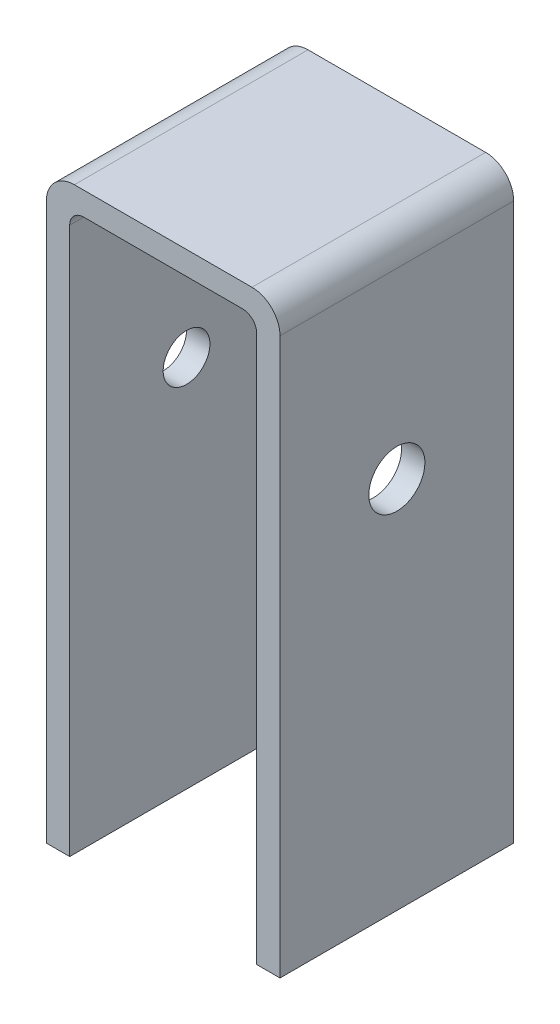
from build123d import *

# Parameters (mm, degrees)
EXTRUSION1_DEPTH                 = 50
ESQUISSE2_R                      = 6
ENL_V_MAT_EXTRU_1_DEPTH          = 5
TROU_TARAUD_M10X1_51_D           = 8.5
TROU_TARAUD_M10X1_51_CBORE_D     = 10
TROU_TARAUD_M10X1_51_CBORE_DEPTH = 20


with BuildPart() as part:
    # Esquisse1 → Extrusion1 (new body)
    with BuildSketch(Plane.XY):
        with BuildLine():
            Line((0, 0), (5, 0))
            Line((5, 0), (5, 117))
            ThreePointArc((5, 117), (5.878679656, 119.121320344), (8, 120))
            Line((8, 120), (42, 120))
            ThreePointArc((42, 120), (44.121320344, 119.121320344), (45, 117))
            Line((45, 117), (45, 0))
            Line((45, 0), (50, 0))
            Line((50, 0), (50, 119))
            ThreePointArc((50, 119), (48.242640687, 123.242640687), (44, 125))
            Line((44, 125), (6, 125))
            ThreePointArc((6, 125), (1.757359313, 123.242640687), (0, 119))
            Line((0, 119), (0, 0))
        make_face()
    extrude(amount=EXTRUSION1_DEPTH)

    # Esquisse2 → Enl_v. mat.-Extru.1 (cut)
    with BuildSketch(Plane(origin=(50, 0, 0), x_dir=(0, 0, -1), z_dir=(1, 0, 0))):
        with Locations(Location((-25, 80, 0), (0, 0, 90))):
            Circle(ESQUISSE2_R)
    extrude(amount=-ENL_V_MAT_EXTRU_1_DEPTH, mode=Mode.SUBTRACT)

    # Trou taraud_ M10x1.51 (through all)
    with Locations(Plane(origin=(5, 0, 0), x_dir=(0, 0, -1), z_dir=(1, 0, 0))):
        with Locations((-25, 80)):
            CounterBoreHole(TROU_TARAUD_M10X1_51_D / 2, TROU_TARAUD_M10X1_51_CBORE_D / 2, TROU_TARAUD_M10X1_51_CBORE_DEPTH)


solid = part.part
